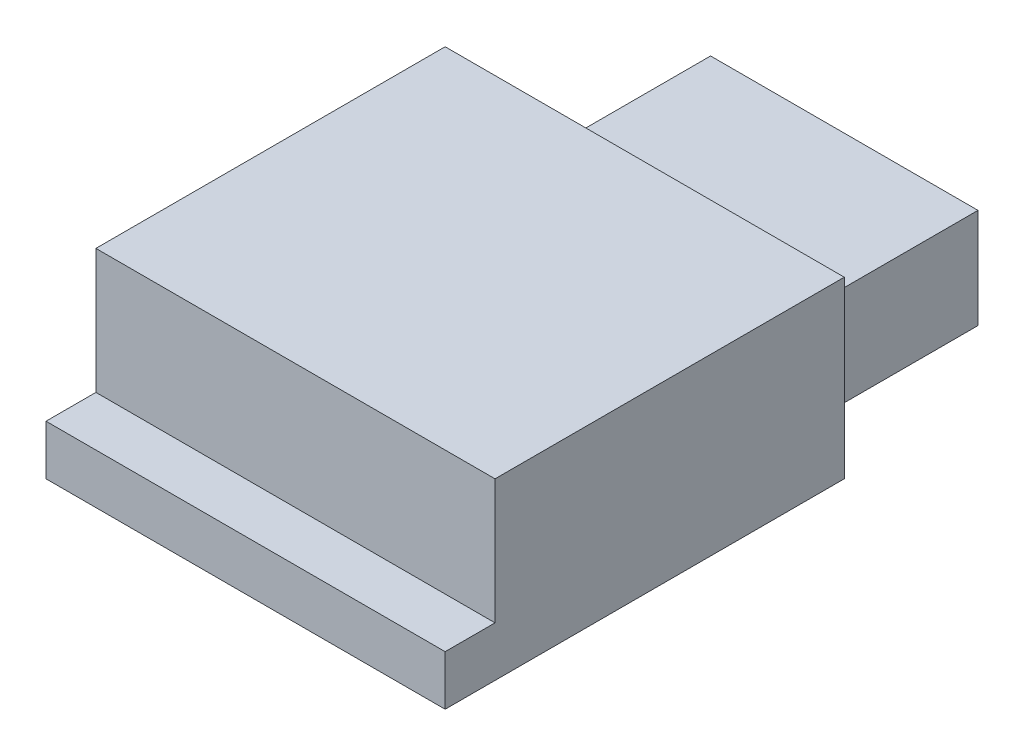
from build123d import *

# Parameters (mm, degrees)
SKETCH1_W      = 10.16
SKETCH1_H      = 10.16
EXTRUDE1_DEPTH = 1.27
SKETCH3_W      = 10.16
SKETCH3_H      = 8.89
EXTRUDE2_DEPTH = 3.175
SKETCH4_W      = 6.8072
SKETCH4_H      = 2.54
EXTRUDE3_DEPTH = 5.08


with BuildPart() as part:
    # Sketch1 → Extrude1 (new body)
    with BuildSketch(Plane(origin=(0, 0, 0), x_dir=(1, 0, 0), z_dir=(0, 1, 0))):
        with Locations((5.08, 5.08)):
            Rectangle(SKETCH1_W, SKETCH1_H)
    extrude(amount=EXTRUDE1_DEPTH)

    # Sketch3 → Extrude2 (add)
    with BuildSketch(Plane(origin=(0, 1.27, 0), x_dir=(-1, 0, 0), z_dir=(0, 1, 0))):
        with Locations((-5.08, -5.715)):
            Rectangle(SKETCH3_W, SKETCH3_H)
    extrude(amount=EXTRUDE2_DEPTH)

    # Sketch4 → Extrude3 (add)
    with BuildSketch(Plane(origin=(0, 0, -10.16), x_dir=(-1, 0, 0), z_dir=(0, 0, -1))):
        with Locations((-5.08, 1.27)):
            Rectangle(SKETCH4_W, SKETCH4_H)
    extrude(amount=EXTRUDE3_DEPTH)


solid = part.part
